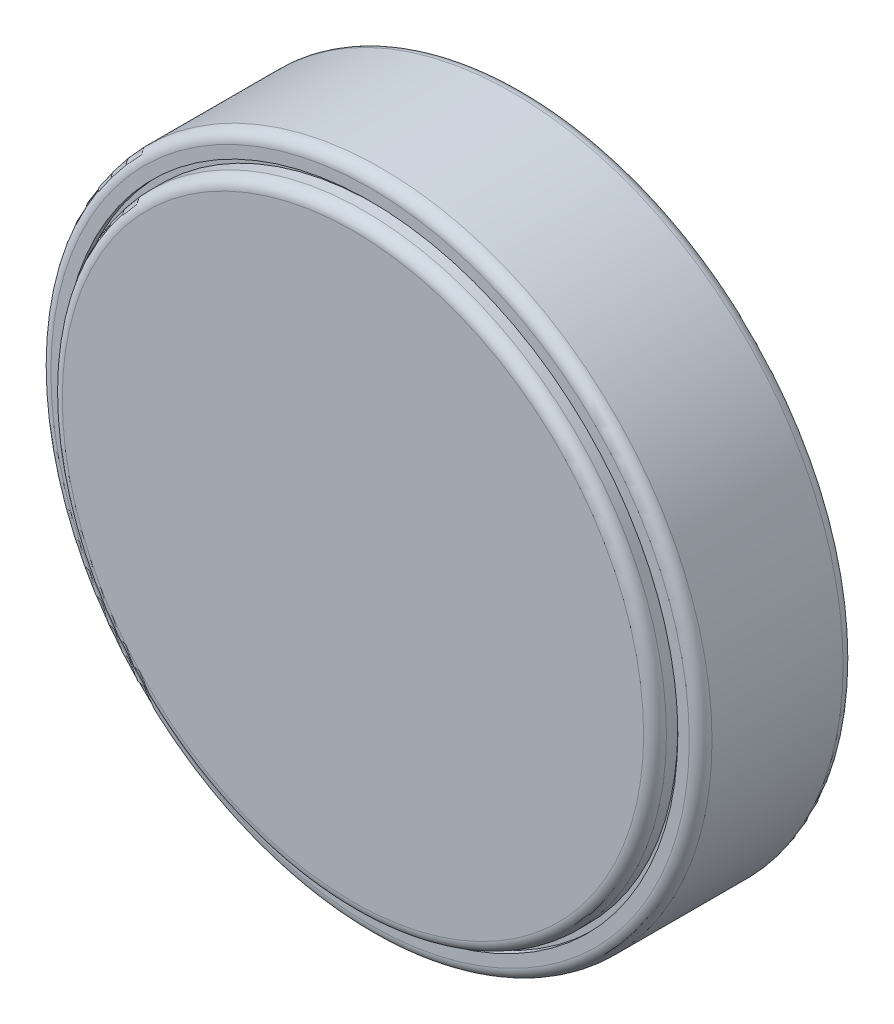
ISO-10303-21;
HEADER;
FILE_DESCRIPTION(('STEP AP214'),'2;1');
FILE_NAME('part.step','',(''),(''),'','','');
FILE_SCHEMA(('AUTOMOTIVE_DESIGN { 1 0 10303 214 1 1 1 1 }'));
ENDSEC;
DATA;
#1=APPLICATION_CONTEXT('core data for automotive mechanical design processes');
#2=APPLICATION_PROTOCOL_DEFINITION('international standard','automotive_design',2000,#1);
#3=PRODUCT_CONTEXT('',#1,'mechanical');
#4=PRODUCT('Part','Part','',(#3));
#5=PRODUCT_RELATED_PRODUCT_CATEGORY('part','',(#4));
#6=PRODUCT_DEFINITION_FORMATION('','',#4);
#7=PRODUCT_DEFINITION_CONTEXT('part definition',#1,'design');
#8=PRODUCT_DEFINITION('design','',#6,#7);
#9=PRODUCT_DEFINITION_SHAPE('','',#8);
#10=(LENGTH_UNIT() NAMED_UNIT(*) SI_UNIT(.MILLI.,.METRE.));
#11=(NAMED_UNIT(*) PLANE_ANGLE_UNIT() SI_UNIT($,.RADIAN.));
#12=(NAMED_UNIT(*) SI_UNIT($,.STERADIAN.) SOLID_ANGLE_UNIT());
#13=UNCERTAINTY_MEASURE_WITH_UNIT(LENGTH_MEASURE(1.E-05),#10,'distance_accuracy_value','');
#14=(GEOMETRIC_REPRESENTATION_CONTEXT(3) GLOBAL_UNCERTAINTY_ASSIGNED_CONTEXT((#13)) GLOBAL_UNIT_ASSIGNED_CONTEXT((#10,
#11,#12)) REPRESENTATION_CONTEXT('',''));
#15=CARTESIAN_POINT('',(0.,0.,0.));
#16=DIRECTION('',(0.,0.,1.));
#17=DIRECTION('',(1.,0.,0.));
#18=AXIS2_PLACEMENT_3D('',#15,#16,#17);
#19=CARTESIAN_POINT('',(0.,0.,2.7));
#20=DIRECTION('',(0.,0.,1.));
#21=DIRECTION('',(1.,0.,0.));
#22=AXIS2_PLACEMENT_3D('',#19,#20,#21);
#23=PLANE('',#22);
#24=CARTESIAN_POINT('',(0.,0.,2.7));
#25=DIRECTION('',(0.,0.,1.));
#26=DIRECTION('',(1.,0.,0.));
#27=AXIS2_PLACEMENT_3D('',#24,#25,#26);
#28=CIRCLE('',#27,5.4);
#29=CARTESIAN_POINT('',(5.4,0.,2.7));
#30=VERTEX_POINT('',#29);
#31=EDGE_CURVE('E51',#30,#30,#28,.T.);
#32=ORIENTED_EDGE('',*,*,#31,.F.);
#33=EDGE_LOOP('',(#32));
#34=FACE_BOUND('',#33,.T.);
#35=CARTESIAN_POINT('',(0.,0.,2.7));
#36=DIRECTION('',(0.,0.,1.));
#37=DIRECTION('',(1.,0.,0.));
#38=AXIS2_PLACEMENT_3D('',#35,#36,#37);
#39=CIRCLE('',#38,5.6);
#40=CARTESIAN_POINT('',(5.6,0.,2.7));
#41=VERTEX_POINT('',#40);
#42=EDGE_CURVE('E33',#41,#41,#39,.T.);
#43=ORIENTED_EDGE('',*,*,#42,.T.);
#44=EDGE_LOOP('',(#43));
#45=FACE_BOUND('',#44,.T.);
#46=ADVANCED_FACE('F22',(#34,#45),#23,.T.);
#47=CARTESIAN_POINT('',(0.,0.,2.7));
#48=DIRECTION('',(0.,0.,-1.));
#49=DIRECTION('',(-1.,0.,0.));
#50=AXIS2_PLACEMENT_3D('',#47,#48,#49);
#51=CYLINDRICAL_SURFACE('',#50,5.8);
#52=CARTESIAN_POINT('',(0.,0.,0.2));
#53=DIRECTION('',(0.,0.,1.));
#54=DIRECTION('',(1.,0.,0.));
#55=AXIS2_PLACEMENT_3D('',#52,#53,#54);
#56=CIRCLE('',#55,5.8);
#57=CARTESIAN_POINT('',(-5.8,0.,0.2));
#58=VERTEX_POINT('',#57);
#59=EDGE_CURVE('E42',#58,#58,#56,.T.);
#60=CARTESIAN_POINT('',(0.,0.,2.5));
#61=DIRECTION('',(0.,0.,1.));
#62=DIRECTION('',(1.,0.,0.));
#63=AXIS2_PLACEMENT_3D('',#60,#61,#62);
#64=CIRCLE('',#63,5.8);
#65=CARTESIAN_POINT('',(-5.8,0.,2.5));
#66=VERTEX_POINT('',#65);
#67=EDGE_CURVE('E45',#66,#66,#64,.F.);
#68=CARTESIAN_POINT('',(-5.8,0.,0.2));
#69=CARTESIAN_POINT('',(-5.8,0.,0.223958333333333));
#70=CARTESIAN_POINT('',(-5.8,0.,0.247916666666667));
#71=CARTESIAN_POINT('',(-5.8,0.,0.295833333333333));
#72=CARTESIAN_POINT('',(-5.8,0.,0.319791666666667));
#73=CARTESIAN_POINT('',(-5.8,0.,0.367708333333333));
#74=CARTESIAN_POINT('',(-5.8,0.,0.391666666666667));
#75=CARTESIAN_POINT('',(-5.8,0.,0.439583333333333));
#76=CARTESIAN_POINT('',(-5.8,0.,0.463541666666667));
#77=CARTESIAN_POINT('',(-5.8,0.,0.511458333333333));
#78=CARTESIAN_POINT('',(-5.8,0.,0.535416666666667));
#79=CARTESIAN_POINT('',(-5.8,0.,0.583333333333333));
#80=CARTESIAN_POINT('',(-5.8,0.,0.607291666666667));
#81=CARTESIAN_POINT('',(-5.8,0.,0.655208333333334));
#82=CARTESIAN_POINT('',(-5.8,0.,0.679166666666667));
#83=CARTESIAN_POINT('',(-5.8,0.,0.727083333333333));
#84=CARTESIAN_POINT('',(-5.8,0.,0.751041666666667));
#85=CARTESIAN_POINT('',(-5.8,0.,0.798958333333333));
#86=CARTESIAN_POINT('',(-5.8,0.,0.822916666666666));
#87=CARTESIAN_POINT('',(-5.8,0.,0.870833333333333));
#88=CARTESIAN_POINT('',(-5.8,0.,0.894791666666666));
#89=CARTESIAN_POINT('',(-5.8,0.,0.942708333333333));
#90=CARTESIAN_POINT('',(-5.8,0.,0.966666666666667));
#91=CARTESIAN_POINT('',(-5.8,0.,1.01458333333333));
#92=CARTESIAN_POINT('',(-5.8,0.,1.03854166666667));
#93=CARTESIAN_POINT('',(-5.8,0.,1.08645833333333));
#94=CARTESIAN_POINT('',(-5.8,0.,1.11041666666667));
#95=CARTESIAN_POINT('',(-5.8,0.,1.15833333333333));
#96=CARTESIAN_POINT('',(-5.8,0.,1.18229166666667));
#97=CARTESIAN_POINT('',(-5.8,0.,1.23020833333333));
#98=CARTESIAN_POINT('',(-5.8,0.,1.25416666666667));
#99=CARTESIAN_POINT('',(-5.8,0.,1.30208333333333));
#100=CARTESIAN_POINT('',(-5.8,0.,1.32604166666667));
#101=CARTESIAN_POINT('',(-5.8,0.,1.37395833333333));
#102=CARTESIAN_POINT('',(-5.8,0.,1.39791666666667));
#103=CARTESIAN_POINT('',(-5.8,0.,1.44583333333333));
#104=CARTESIAN_POINT('',(-5.8,0.,1.46979166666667));
#105=CARTESIAN_POINT('',(-5.8,0.,1.51770833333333));
#106=CARTESIAN_POINT('',(-5.8,0.,1.54166666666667));
#107=CARTESIAN_POINT('',(-5.8,0.,1.58958333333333));
#108=CARTESIAN_POINT('',(-5.8,0.,1.61354166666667));
#109=CARTESIAN_POINT('',(-5.8,0.,1.66145833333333));
#110=CARTESIAN_POINT('',(-5.8,0.,1.68541666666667));
#111=CARTESIAN_POINT('',(-5.8,0.,1.73333333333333));
#112=CARTESIAN_POINT('',(-5.8,0.,1.75729166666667));
#113=CARTESIAN_POINT('',(-5.8,0.,1.80520833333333));
#114=CARTESIAN_POINT('',(-5.8,0.,1.82916666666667));
#115=CARTESIAN_POINT('',(-5.8,0.,1.87708333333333));
#116=CARTESIAN_POINT('',(-5.8,0.,1.90104166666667));
#117=CARTESIAN_POINT('',(-5.8,0.,1.94895833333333));
#118=CARTESIAN_POINT('',(-5.8,0.,1.97291666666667));
#119=CARTESIAN_POINT('',(-5.8,0.,2.02083333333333));
#120=CARTESIAN_POINT('',(-5.8,0.,2.04479166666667));
#121=CARTESIAN_POINT('',(-5.8,0.,2.09270833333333));
#122=CARTESIAN_POINT('',(-5.8,0.,2.11666666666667));
#123=CARTESIAN_POINT('',(-5.8,0.,2.16458333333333));
#124=CARTESIAN_POINT('',(-5.8,0.,2.18854166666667));
#125=CARTESIAN_POINT('',(-5.8,0.,2.23645833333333));
#126=CARTESIAN_POINT('',(-5.8,0.,2.26041666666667));
#127=CARTESIAN_POINT('',(-5.8,0.,2.30833333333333));
#128=CARTESIAN_POINT('',(-5.8,0.,2.33229166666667));
#129=CARTESIAN_POINT('',(-5.8,0.,2.38020833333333));
#130=CARTESIAN_POINT('',(-5.8,0.,2.40416666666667));
#131=CARTESIAN_POINT('',(-5.8,0.,2.45208333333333));
#132=CARTESIAN_POINT('',(-5.8,0.,2.47604166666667));
#133=CARTESIAN_POINT('',(-5.8,0.,2.5));
#134=B_SPLINE_CURVE_WITH_KNOTS('',3,(#68,#69,#70,#71,#72,#73,#74,#75,#76,#77,#78,#79,#80,#81,
#82,#83,#84,#85,#86,#87,#88,#89,#90,#91,#92,#93,#94,#95,#96,#97,#98,#99,#100,#101,#102,#103,
#104,#105,#106,#107,#108,#109,#110,#111,#112,#113,#114,#115,#116,#117,#118,#119,#120,#121,#122,
#123,#124,#125,#126,#127,#128,#129,#130,#131,#132,#133),.UNSPECIFIED.,.F.,.F.,(4,2,2,2,2,2,2,2,
2,2,2,2,2,2,2,2,2,2,2,2,2,2,2,2,2,2,2,2,2,2,2,2,4),(0.,0.0718749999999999,0.14375,0.215625,
0.2875,0.359375,0.43125,0.503125,0.575,0.646875,0.71875,0.790625,0.8625,0.934375,1.00625,
1.078125,1.15,1.221875,1.29375,1.365625,1.4375,1.509375,1.58125,1.653125,1.725,1.796875,1.86875,
1.940625,2.0125,2.084375,2.15625,2.228125,2.3),.UNSPECIFIED.);
#135=EDGE_CURVE('BSEAM24',#58,#66,#134,.T.);
#136=ORIENTED_EDGE('',*,*,#59,.T.);
#137=ORIENTED_EDGE('',*,*,#67,.T.);
#138=ORIENTED_EDGE('',*,*,#135,.T.);
#139=ORIENTED_EDGE('',*,*,#135,.F.);
#140=EDGE_LOOP('',(#136,#138,#137,#139));
#141=FACE_BOUND('',#140,.T.);
#142=ADVANCED_FACE('F24',(#141),#51,.T.);
#143=CARTESIAN_POINT('',(0.,0.,0.));
#144=DIRECTION('',(0.,0.,1.));
#145=DIRECTION('',(1.,0.,0.));
#146=AXIS2_PLACEMENT_3D('',#143,#144,#145);
#147=PLANE('',#146);
#148=CARTESIAN_POINT('',(0.,0.,0.));
#149=DIRECTION('',(0.,0.,1.));
#150=DIRECTION('',(1.,0.,0.));
#151=AXIS2_PLACEMENT_3D('',#148,#149,#150);
#152=CIRCLE('',#151,5.6);
#153=CARTESIAN_POINT('',(5.6,0.,0.));
#154=VERTEX_POINT('',#153);
#155=EDGE_CURVE('E37',#154,#154,#152,.F.);
#156=ORIENTED_EDGE('',*,*,#155,.T.);
#157=EDGE_LOOP('',(#156));
#158=FACE_BOUND('',#157,.T.);
#159=ADVANCED_FACE('F85',(#158),#147,.F.);
#160=CARTESIAN_POINT('',(0.,0.,0.2));
#161=DIRECTION('',(0.,0.,1.));
#162=DIRECTION('',(1.,0.,0.));
#163=AXIS2_PLACEMENT_3D('',#160,#161,#162);
#164=TOROIDAL_SURFACE('',#163,5.6,0.2);
#165=ORIENTED_EDGE('',*,*,#155,.F.);
#166=EDGE_LOOP('',(#165));
#167=FACE_BOUND('',#166,.T.);
#168=ORIENTED_EDGE('',*,*,#59,.F.);
#169=EDGE_LOOP('',(#168));
#170=FACE_BOUND('',#169,.T.);
#171=ADVANCED_FACE('F79',(#167,#170),#164,.T.);
#172=CARTESIAN_POINT('',(0.,0.,2.5));
#173=DIRECTION('',(0.,0.,1.));
#174=DIRECTION('',(1.,0.,0.));
#175=AXIS2_PLACEMENT_3D('',#172,#173,#174);
#176=TOROIDAL_SURFACE('',#175,5.6,0.2);
#177=ORIENTED_EDGE('',*,*,#67,.F.);
#178=EDGE_LOOP('',(#177));
#179=FACE_BOUND('',#178,.T.);
#180=ORIENTED_EDGE('',*,*,#42,.F.);
#181=EDGE_LOOP('',(#180));
#182=FACE_BOUND('',#181,.T.);
#183=ADVANCED_FACE('F70',(#179,#182),#176,.T.);
#184=CARTESIAN_POINT('',(0.,0.,2.6));
#185=DIRECTION('',(0.,0.,1.));
#186=DIRECTION('',(1.,0.,0.));
#187=AXIS2_PLACEMENT_3D('',#184,#185,#186);
#188=CYLINDRICAL_SURFACE('',#187,5.4);
#189=CARTESIAN_POINT('',(0.,0.,2.6));
#190=DIRECTION('',(0.,0.,1.));
#191=DIRECTION('',(1.,0.,0.));
#192=AXIS2_PLACEMENT_3D('',#189,#190,#191);
#193=CIRCLE('',#192,5.4);
#194=CARTESIAN_POINT('',(5.4,0.,2.6));
#195=VERTEX_POINT('',#194);
#196=EDGE_CURVE('E48',#195,#195,#193,.T.);
#197=ORIENTED_EDGE('',*,*,#196,.F.);
#198=EDGE_LOOP('',(#197));
#199=FACE_BOUND('',#198,.T.);
#200=ORIENTED_EDGE('',*,*,#31,.T.);
#201=EDGE_LOOP('',(#200));
#202=FACE_BOUND('',#201,.T.);
#203=ADVANCED_FACE('F64',(#199,#202),#188,.F.);
#204=CARTESIAN_POINT('',(0.,0.,2.6));
#205=DIRECTION('',(0.,0.,1.));
#206=DIRECTION('',(1.,0.,0.));
#207=AXIS2_PLACEMENT_3D('',#204,#205,#206);
#208=PLANE('',#207);
#209=CARTESIAN_POINT('',(0.,0.,2.6));
#210=DIRECTION('',(0.,0.,1.));
#211=DIRECTION('',(1.,0.,0.));
#212=AXIS2_PLACEMENT_3D('',#209,#210,#211);
#213=CIRCLE('',#212,5.3);
#214=CARTESIAN_POINT('',(5.3,0.,2.6));
#215=VERTEX_POINT('',#214);
#216=EDGE_CURVE('E54',#215,#215,#213,.T.);
#217=ORIENTED_EDGE('',*,*,#216,.F.);
#218=EDGE_LOOP('',(#217));
#219=FACE_BOUND('',#218,.T.);
#220=ORIENTED_EDGE('',*,*,#196,.T.);
#221=EDGE_LOOP('',(#220));
#222=FACE_BOUND('',#221,.T.);
#223=ADVANCED_FACE('F60',(#219,#222),#208,.T.);
#224=CARTESIAN_POINT('',(0.,0.,3.));
#225=DIRECTION('',(0.,0.,1.));
#226=DIRECTION('',(1.,0.,0.));
#227=AXIS2_PLACEMENT_3D('',#224,#225,#226);
#228=PLANE('',#227);
#229=CARTESIAN_POINT('',(0.,0.,3.));
#230=DIRECTION('',(0.,0.,1.));
#231=DIRECTION('',(1.,0.,0.));
#232=AXIS2_PLACEMENT_3D('',#229,#230,#231);
#233=CIRCLE('',#232,5.1);
#234=CARTESIAN_POINT('',(5.1,0.,3.));
#235=VERTEX_POINT('',#234);
#236=EDGE_CURVE('E29',#235,#235,#233,.T.);
#237=ORIENTED_EDGE('',*,*,#236,.T.);
#238=EDGE_LOOP('',(#237));
#239=FACE_BOUND('',#238,.T.);
#240=ADVANCED_FACE('F63',(#239),#228,.T.);
#241=CARTESIAN_POINT('',(0.,0.,2.8));
#242=DIRECTION('',(0.,0.,1.));
#243=DIRECTION('',(1.,0.,0.));
#244=AXIS2_PLACEMENT_3D('',#241,#242,#243);
#245=TOROIDAL_SURFACE('',#244,5.1,0.2);
#246=CARTESIAN_POINT('',(0.,0.,2.8));
#247=DIRECTION('',(0.,0.,1.));
#248=DIRECTION('',(1.,0.,0.));
#249=AXIS2_PLACEMENT_3D('',#246,#247,#248);
#250=CIRCLE('',#249,5.3);
#251=CARTESIAN_POINT('',(5.3,0.,2.8));
#252=VERTEX_POINT('',#251);
#253=EDGE_CURVE('E10',#252,#252,#250,.F.);
#254=ORIENTED_EDGE('',*,*,#253,.F.);
#255=EDGE_LOOP('',(#254));
#256=FACE_BOUND('',#255,.T.);
#257=ORIENTED_EDGE('',*,*,#236,.F.);
#258=EDGE_LOOP('',(#257));
#259=FACE_BOUND('',#258,.T.);
#260=ADVANCED_FACE('F90',(#256,#259),#245,.T.);
#261=CARTESIAN_POINT('',(0.,0.,3.));
#262=DIRECTION('',(0.,0.,-1.));
#263=DIRECTION('',(-1.,0.,0.));
#264=AXIS2_PLACEMENT_3D('',#261,#262,#263);
#265=CYLINDRICAL_SURFACE('',#264,5.3);
#266=ORIENTED_EDGE('',*,*,#253,.T.);
#267=EDGE_LOOP('',(#266));
#268=FACE_BOUND('',#267,.T.);
#269=ORIENTED_EDGE('',*,*,#216,.T.);
#270=EDGE_LOOP('',(#269));
#271=FACE_BOUND('',#270,.T.);
#272=ADVANCED_FACE('F58',(#268,#271),#265,.T.);
#273=CLOSED_SHELL('',(#46,#142,#159,#171,#183,#203,#223,#240,#260,#272));
#274=MANIFOLD_SOLID_BREP('B2',#273);
#275=ADVANCED_BREP_SHAPE_REPRESENTATION('',(#18,#274),#14);
#276=SHAPE_DEFINITION_REPRESENTATION(#9,#275);
ENDSEC;
END-ISO-10303-21;
